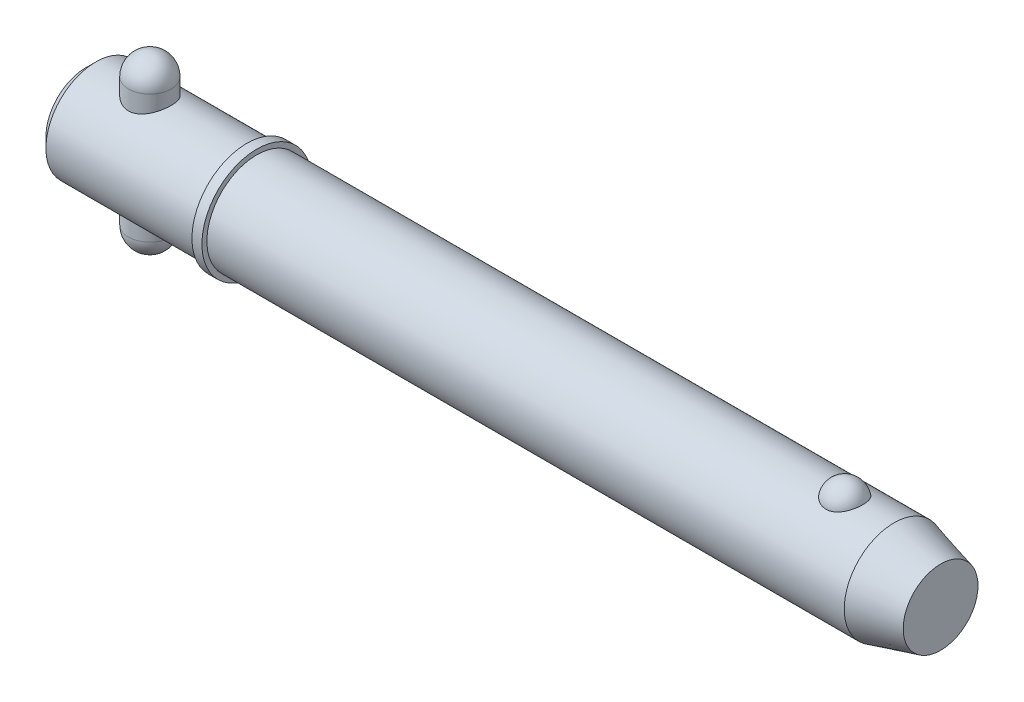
ISO-10303-21;
HEADER;
FILE_DESCRIPTION(('STEP AP214'),'2;1');
FILE_NAME('part.step','',(''),(''),'','','');
FILE_SCHEMA(('AUTOMOTIVE_DESIGN { 1 0 10303 214 1 1 1 1 }'));
ENDSEC;
DATA;
#1=APPLICATION_CONTEXT('core data for automotive mechanical design processes');
#2=APPLICATION_PROTOCOL_DEFINITION('international standard','automotive_design',2000,#1);
#3=PRODUCT_CONTEXT('',#1,'mechanical');
#4=PRODUCT('Part','Part','',(#3));
#5=PRODUCT_RELATED_PRODUCT_CATEGORY('part','',(#4));
#6=PRODUCT_DEFINITION_FORMATION('','',#4);
#7=PRODUCT_DEFINITION_CONTEXT('part definition',#1,'design');
#8=PRODUCT_DEFINITION('design','',#6,#7);
#9=PRODUCT_DEFINITION_SHAPE('','',#8);
#10=(LENGTH_UNIT() NAMED_UNIT(*) SI_UNIT(.MILLI.,.METRE.));
#11=(NAMED_UNIT(*) PLANE_ANGLE_UNIT() SI_UNIT($,.RADIAN.));
#12=(NAMED_UNIT(*) SI_UNIT($,.STERADIAN.) SOLID_ANGLE_UNIT());
#13=UNCERTAINTY_MEASURE_WITH_UNIT(LENGTH_MEASURE(1.E-05),#10,'distance_accuracy_value','');
#14=(GEOMETRIC_REPRESENTATION_CONTEXT(3) GLOBAL_UNCERTAINTY_ASSIGNED_CONTEXT((#13)) GLOBAL_UNIT_ASSIGNED_CONTEXT((#10,
#11,#12)) REPRESENTATION_CONTEXT('',''));
#15=CARTESIAN_POINT('',(0.,0.,0.));
#16=DIRECTION('',(0.,0.,1.));
#17=DIRECTION('',(1.,0.,0.));
#18=AXIS2_PLACEMENT_3D('',#15,#16,#17);
#19=CARTESIAN_POINT('',(14.28,19.05,0.));
#20=DIRECTION('',(0.,-1.,0.));
#21=DIRECTION('',(0.,0.,-1.));
#22=AXIS2_PLACEMENT_3D('',#19,#20,#21);
#23=CYLINDRICAL_SURFACE('',#22,4.76);
#24=CARTESIAN_POINT('',(14.28,-14.29,0.));
#25=DIRECTION('',(0.,-1.,0.));
#26=DIRECTION('',(0.,0.,-1.));
#27=AXIS2_PLACEMENT_3D('',#24,#25,#26);
#28=CIRCLE('',#27,4.76);
#29=CARTESIAN_POINT('',(14.28,-14.29,-4.76));
#30=VERTEX_POINT('',#29);
#31=EDGE_CURVE('P0_E10',#30,#30,#28,.F.);
#32=CARTESIAN_POINT('',(14.28,14.29,0.));
#33=DIRECTION('',(0.,-1.,0.));
#34=DIRECTION('',(0.,0.,-1.));
#35=AXIS2_PLACEMENT_3D('',#32,#33,#34);
#36=CIRCLE('',#35,4.76);
#37=CARTESIAN_POINT('',(14.28,14.29,-4.76));
#38=VERTEX_POINT('',#37);
#39=EDGE_CURVE('P0_E21',#38,#38,#36,.T.);
#40=CARTESIAN_POINT('',(14.28,-14.29,-4.76));
#41=CARTESIAN_POINT('',(14.28,-13.9922916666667,-4.76));
#42=CARTESIAN_POINT('',(14.28,-13.6945833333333,-4.76));
#43=CARTESIAN_POINT('',(14.28,-13.0991666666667,-4.76));
#44=CARTESIAN_POINT('',(14.28,-12.8014583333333,-4.76));
#45=CARTESIAN_POINT('',(14.28,-12.2060416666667,-4.76));
#46=CARTESIAN_POINT('',(14.28,-11.9083333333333,-4.76));
#47=CARTESIAN_POINT('',(14.28,-11.3129166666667,-4.76));
#48=CARTESIAN_POINT('',(14.28,-11.0152083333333,-4.76));
#49=CARTESIAN_POINT('',(14.28,-10.4197916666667,-4.76));
#50=CARTESIAN_POINT('',(14.28,-10.1220833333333,-4.76));
#51=CARTESIAN_POINT('',(14.28,-9.52666666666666,-4.76));
#52=CARTESIAN_POINT('',(14.28,-9.22895833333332,-4.76));
#53=CARTESIAN_POINT('',(14.28,-8.63354166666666,-4.76));
#54=CARTESIAN_POINT('',(14.28,-8.33583333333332,-4.76));
#55=CARTESIAN_POINT('',(14.28,-7.74041666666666,-4.76));
#56=CARTESIAN_POINT('',(14.28,-7.44270833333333,-4.76));
#57=CARTESIAN_POINT('',(14.28,-6.84729166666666,-4.76));
#58=CARTESIAN_POINT('',(14.28,-6.54958333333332,-4.76));
#59=CARTESIAN_POINT('',(14.28,-5.95416666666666,-4.76));
#60=CARTESIAN_POINT('',(14.28,-5.65645833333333,-4.76));
#61=CARTESIAN_POINT('',(14.28,-5.06104166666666,-4.76));
#62=CARTESIAN_POINT('',(14.28,-4.76333333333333,-4.76));
#63=CARTESIAN_POINT('',(14.28,-4.16791666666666,-4.76));
#64=CARTESIAN_POINT('',(14.28,-3.87020833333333,-4.76));
#65=CARTESIAN_POINT('',(14.28,-3.27479166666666,-4.76));
#66=CARTESIAN_POINT('',(14.28,-2.97708333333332,-4.76));
#67=CARTESIAN_POINT('',(14.28,-2.38166666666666,-4.76));
#68=CARTESIAN_POINT('',(14.28,-2.08395833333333,-4.76));
#69=CARTESIAN_POINT('',(14.28,-1.48854166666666,-4.76));
#70=CARTESIAN_POINT('',(14.28,-1.19083333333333,-4.76));
#71=CARTESIAN_POINT('',(14.28,-0.595416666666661,-4.76));
#72=CARTESIAN_POINT('',(14.28,-0.297708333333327,-4.76));
#73=CARTESIAN_POINT('',(14.28,0.297708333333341,-4.76));
#74=CARTESIAN_POINT('',(14.28,0.595416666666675,-4.76));
#75=CARTESIAN_POINT('',(14.28,1.19083333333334,-4.76));
#76=CARTESIAN_POINT('',(14.28,1.48854166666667,-4.76));
#77=CARTESIAN_POINT('',(14.28,2.08395833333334,-4.76));
#78=CARTESIAN_POINT('',(14.28,2.38166666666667,-4.76));
#79=CARTESIAN_POINT('',(14.28,2.97708333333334,-4.76));
#80=CARTESIAN_POINT('',(14.28,3.27479166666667,-4.76));
#81=CARTESIAN_POINT('',(14.28,3.87020833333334,-4.76));
#82=CARTESIAN_POINT('',(14.28,4.16791666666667,-4.76));
#83=CARTESIAN_POINT('',(14.28,4.76333333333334,-4.76));
#84=CARTESIAN_POINT('',(14.28,5.06104166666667,-4.76));
#85=CARTESIAN_POINT('',(14.28,5.65645833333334,-4.76));
#86=CARTESIAN_POINT('',(14.28,5.95416666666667,-4.76));
#87=CARTESIAN_POINT('',(14.28,6.54958333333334,-4.76));
#88=CARTESIAN_POINT('',(14.28,6.84729166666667,-4.76));
#89=CARTESIAN_POINT('',(14.28,7.44270833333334,-4.76));
#90=CARTESIAN_POINT('',(14.28,7.74041666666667,-4.76));
#91=CARTESIAN_POINT('',(14.28,8.33583333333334,-4.76));
#92=CARTESIAN_POINT('',(14.28,8.63354166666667,-4.76));
#93=CARTESIAN_POINT('',(14.28,9.22895833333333,-4.76));
#94=CARTESIAN_POINT('',(14.28,9.52666666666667,-4.76));
#95=CARTESIAN_POINT('',(14.28,10.1220833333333,-4.76));
#96=CARTESIAN_POINT('',(14.28,10.4197916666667,-4.76));
#97=CARTESIAN_POINT('',(14.28,11.0152083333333,-4.76));
#98=CARTESIAN_POINT('',(14.28,11.3129166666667,-4.76));
#99=CARTESIAN_POINT('',(14.28,11.9083333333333,-4.76));
#100=CARTESIAN_POINT('',(14.28,12.2060416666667,-4.76));
#101=CARTESIAN_POINT('',(14.28,12.8014583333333,-4.76));
#102=CARTESIAN_POINT('',(14.28,13.0991666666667,-4.76));
#103=CARTESIAN_POINT('',(14.28,13.6945833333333,-4.76));
#104=CARTESIAN_POINT('',(14.28,13.9922916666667,-4.76));
#105=CARTESIAN_POINT('',(14.28,14.29,-4.76));
#106=B_SPLINE_CURVE_WITH_KNOTS('',3,(#40,#41,#42,#43,#44,#45,#46,#47,#48,#49,#50,#51,#52,#53,
#54,#55,#56,#57,#58,#59,#60,#61,#62,#63,#64,#65,#66,#67,#68,#69,#70,#71,#72,#73,#74,#75,#76,#77,
#78,#79,#80,#81,#82,#83,#84,#85,#86,#87,#88,#89,#90,#91,#92,#93,#94,#95,#96,#97,#98,#99,#100,
#101,#102,#103,#104,#105),.UNSPECIFIED.,.F.,.F.,(4,2,2,2,2,2,2,2,2,2,2,2,2,2,2,2,2,2,2,2,2,2,2,
2,2,2,2,2,2,2,2,2,4),(0.,0.893125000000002,1.78625,2.67937499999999,3.5725,4.465625,5.35875,
6.25187499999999,7.145,8.038125,8.93125,9.82437499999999,10.7175,11.610625,12.50375,13.396875,
14.29,15.183125,16.07625,16.969375,17.8625,18.755625,19.64875,20.541875,21.435,22.328125,
23.22125,24.114375,25.0075,25.900625,26.79375,27.686875,28.58),.UNSPECIFIED.);
#107=EDGE_CURVE('P0_BSEAM14',#30,#38,#106,.T.);
#108=ORIENTED_EDGE('',*,*,#31,.T.);
#109=ORIENTED_EDGE('',*,*,#39,.T.);
#110=ORIENTED_EDGE('',*,*,#107,.T.);
#111=ORIENTED_EDGE('',*,*,#107,.F.);
#112=EDGE_LOOP('',(#108,#110,#109,#111));
#113=FACE_BOUND('',#112,.T.);
#114=ADVANCED_FACE('P0_F14',(#113),#23,.T.);
#115=CARTESIAN_POINT('',(14.28,-14.29,0.));
#116=DIRECTION('',(0.,0.,1.));
#117=DIRECTION('',(1.,0.,0.));
#118=AXIS2_PLACEMENT_3D('',#115,#116,#117);
#119=SPHERICAL_SURFACE('',#118,4.76);
#120=CARTESIAN_POINT('',(14.28,-14.29,0.));
#121=DIRECTION('',(0.,-1.,0.));
#122=DIRECTION('',(0.,0.,-1.));
#123=AXIS2_PLACEMENT_3D('',#120,#121,#122);
#124=SPHERICAL_SURFACE('',#123,4.76);
#125=ORIENTED_EDGE('',*,*,#31,.F.);
#126=EDGE_LOOP('',(#125));
#127=FACE_BOUND('',#126,.T.);
#128=ADVANCED_FACE('P0_F29',(#127),#124,.T.);
#129=CARTESIAN_POINT('',(14.28,14.29,0.));
#130=DIRECTION('',(0.,0.,1.));
#131=DIRECTION('',(1.,0.,0.));
#132=AXIS2_PLACEMENT_3D('',#129,#130,#131);
#133=SPHERICAL_SURFACE('',#132,4.76);
#134=CARTESIAN_POINT('',(14.28,14.29,0.));
#135=DIRECTION('',(0.,-1.,0.));
#136=DIRECTION('',(0.,0.,-1.));
#137=AXIS2_PLACEMENT_3D('',#134,#135,#136);
#138=SPHERICAL_SURFACE('',#137,4.76);
#139=ORIENTED_EDGE('',*,*,#39,.F.);
#140=EDGE_LOOP('',(#139));
#141=FACE_BOUND('',#140,.T.);
#142=ADVANCED_FACE('P0_F16',(#141),#138,.T.);
#143=CLOSED_SHELL('',(#114,#128,#142));
#144=MANIFOLD_SOLID_BREP('P0_B1',#143);
#145=CARTESIAN_POINT('',(0.,0.,0.));
#146=DIRECTION('',(1.,0.,0.));
#147=DIRECTION('',(0.,0.,-1.));
#148=AXIS2_PLACEMENT_3D('',#145,#146,#147);
#149=CYLINDRICAL_SURFACE('',#148,11.115);
#150=CARTESIAN_POINT('',(180.129563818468,0.,0.));
#151=DIRECTION('',(1.,0.,0.));
#152=DIRECTION('',(0.,0.,-1.));
#153=AXIS2_PLACEMENT_3D('',#150,#151,#152);
#154=CIRCLE('',#153,11.115);
#155=CARTESIAN_POINT('',(180.129563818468,0.,-11.115));
#156=VERTEX_POINT('',#155);
#157=EDGE_CURVE('P1_E81',#156,#156,#154,.T.);
#158=ORIENTED_EDGE('',*,*,#157,.F.);
#159=EDGE_LOOP('',(#158));
#160=FACE_BOUND('',#159,.T.);
#161=CARTESIAN_POINT('',(38.1,0.,0.));
#162=DIRECTION('',(1.,0.,0.));
#163=DIRECTION('',(0.,0.,-1.));
#164=AXIS2_PLACEMENT_3D('',#161,#162,#163);
#165=CIRCLE('',#164,11.115);
#166=CARTESIAN_POINT('',(38.1,0.,-11.115));
#167=VERTEX_POINT('',#166);
#168=EDGE_CURVE('P1_E85',#167,#167,#165,.T.);
#169=ORIENTED_EDGE('',*,*,#168,.T.);
#170=EDGE_LOOP('',(#169));
#171=FACE_BOUND('',#170,.T.);
#172=CARTESIAN_POINT('',(169.131068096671,10.3028087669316,4.17077409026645));
#173=CARTESIAN_POINT('',(168.914775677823,10.3028003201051,4.17078240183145));
#174=CARTESIAN_POINT('',(168.698548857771,10.3098895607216,4.15340593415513));
#175=CARTESIAN_POINT('',(168.272540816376,10.3373834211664,4.08449540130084));
#176=CARTESIAN_POINT('',(168.062757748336,10.3577841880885,4.03297121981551));
#177=CARTESIAN_POINT('',(167.655782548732,10.4095237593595,3.89746513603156));
#178=CARTESIAN_POINT('',(167.458572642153,10.4408466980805,3.81353029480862));
#179=CARTESIAN_POINT('',(167.081338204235,10.5110236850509,3.61560339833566));
#180=CARTESIAN_POINT('',(166.901317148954,10.5498792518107,3.50160528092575));
#181=CARTESIAN_POINT('',(166.557684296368,10.6322884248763,3.24292464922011));
#182=CARTESIAN_POINT('',(166.394686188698,10.6759443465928,3.09746040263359));
#183=CARTESIAN_POINT('',(166.094591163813,10.7625291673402,2.7817192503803));
#184=CARTESIAN_POINT('',(165.957499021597,10.8054579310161,2.61143778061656));
#185=CARTESIAN_POINT('',(165.706408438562,10.8881935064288,2.24226695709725));
#186=CARTESIAN_POINT('',(165.593710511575,10.9277761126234,2.04244123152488));
#187=CARTESIAN_POINT('',(165.401777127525,10.997484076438,1.62578254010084));
#188=CARTESIAN_POINT('',(165.322544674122,11.0276085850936,1.40894804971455));
#189=CARTESIAN_POINT('',(165.198303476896,11.0756732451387,0.961250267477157));
#190=CARTESIAN_POINT('',(165.153760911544,11.0934470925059,0.73023943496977));
#191=CARTESIAN_POINT('',(165.101569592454,11.1143331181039,0.263439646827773));
#192=CARTESIAN_POINT('',(165.093920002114,11.1174456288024,0.0276507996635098));
#193=CARTESIAN_POINT('',(165.11561056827,11.1087161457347,-0.440729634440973));
#194=CARTESIAN_POINT('',(165.144762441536,11.0969502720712,-0.673331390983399));
#195=CARTESIAN_POINT('',(165.239143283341,11.0597872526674,-1.12996621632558));
#196=CARTESIAN_POINT('',(165.304372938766,11.0343898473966,-1.35399912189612));
#197=CARTESIAN_POINT('',(165.46969844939,10.972515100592,-1.78750286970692));
#198=CARTESIAN_POINT('',(165.56983863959,10.9360236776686,-1.99695478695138));
#199=CARTESIAN_POINT('',(165.802940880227,10.8557595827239,-2.39520667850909));
#200=CARTESIAN_POINT('',(165.935905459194,10.8119863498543,-2.58400506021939));
#201=CARTESIAN_POINT('',(166.232407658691,10.7216733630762,-2.93635726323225));
#202=CARTESIAN_POINT('',(166.396056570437,10.675123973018,-3.09981510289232));
#203=CARTESIAN_POINT('',(166.749860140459,10.5846571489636,-3.39592247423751));
#204=CARTESIAN_POINT('',(166.940012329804,10.5407394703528,-3.52857487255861));
#205=CARTESIAN_POINT('',(167.33750141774,10.4616690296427,-3.75646057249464));
#206=CARTESIAN_POINT('',(167.54436705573,10.4263443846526,-3.85245432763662));
#207=CARTESIAN_POINT('',(167.97295417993,10.3675574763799,-4.0079874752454));
#208=CARTESIAN_POINT('',(168.194670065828,10.344090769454,-4.06754052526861));
#209=CARTESIAN_POINT('',(168.634669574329,10.3128282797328,-4.14614314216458));
#210=CARTESIAN_POINT('',(168.852565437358,10.3043040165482,-4.1670783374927));
#211=CARTESIAN_POINT('',(169.28894951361,10.3016771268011,-4.17357158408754));
#212=CARTESIAN_POINT('',(169.507437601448,10.3075716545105,-4.15913661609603));
#213=CARTESIAN_POINT('',(169.931744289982,10.3326686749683,-4.09636961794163));
#214=CARTESIAN_POINT('',(170.137745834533,10.3514555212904,-4.0490957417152));
#215=CARTESIAN_POINT('',(170.538576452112,10.399818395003,-3.92320197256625));
#216=CARTESIAN_POINT('',(170.7334046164,10.4293952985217,-3.84457953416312));
#217=CARTESIAN_POINT('',(171.111191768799,10.4969600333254,-3.65612410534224));
#218=CARTESIAN_POINT('',(171.293797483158,10.5351178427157,-3.54564545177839));
#219=CARTESIAN_POINT('',(171.638204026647,10.6154999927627,-3.29718036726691));
#220=CARTESIAN_POINT('',(171.800000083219,10.657725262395,-3.15918764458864));
#221=CARTESIAN_POINT('',(172.106959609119,10.744212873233,-2.85163580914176));
#222=CARTESIAN_POINT('',(172.250891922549,10.7884718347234,-2.68084605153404));
#223=CARTESIAN_POINT('',(172.509237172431,10.872374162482,-2.31721864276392));
#224=CARTESIAN_POINT('',(172.623644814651,10.9120167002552,-2.12437704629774));
#225=CARTESIAN_POINT('',(172.823873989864,10.9838919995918,-1.71516999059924));
#226=CARTESIAN_POINT('',(172.90866178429,11.0158465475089,-1.49824866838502));
#227=CARTESIAN_POINT('',(173.04268382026,11.0673523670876,-1.05228572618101));
#228=CARTESIAN_POINT('',(173.091917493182,11.086903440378,-0.823243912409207));
#229=CARTESIAN_POINT('',(173.153891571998,11.1116323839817,-0.359087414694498));
#230=CARTESIAN_POINT('',(173.166566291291,11.1167843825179,-0.12396256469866));
#231=CARTESIAN_POINT('',(173.154973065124,11.1121144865,0.345220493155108));
#232=CARTESIAN_POINT('',(173.130705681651,11.1022928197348,0.579278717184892));
#233=CARTESIAN_POINT('',(173.045907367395,11.0687504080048,1.03866534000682));
#234=CARTESIAN_POINT('',(172.985529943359,11.0450885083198,1.26402641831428));
#235=CARTESIAN_POINT('',(172.829853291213,10.9863185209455,1.70076772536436));
#236=CARTESIAN_POINT('',(172.734551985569,10.9512097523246,1.91214712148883));
#237=CARTESIAN_POINT('',(172.510397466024,10.8729733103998,2.316083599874));
#238=CARTESIAN_POINT('',(172.381380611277,10.8298068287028,2.50854240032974));
#239=CARTESIAN_POINT('',(172.092732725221,10.7401896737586,2.86808766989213));
#240=CARTESIAN_POINT('',(171.933102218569,10.6937390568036,3.03517457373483));
#241=CARTESIAN_POINT('',(171.587534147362,10.6029321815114,3.33857581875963));
#242=CARTESIAN_POINT('',(171.401708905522,10.5585680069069,3.47501541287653));
#243=CARTESIAN_POINT('',(171.007875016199,10.4769321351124,3.71390897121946));
#244=CARTESIAN_POINT('',(170.799863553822,10.439661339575,3.81635861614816));
#245=CARTESIAN_POINT('',(170.354066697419,10.3749407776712,3.98910631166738));
#246=CARTESIAN_POINT('',(170.115234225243,10.3482457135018,4.05700929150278));
#247=CARTESIAN_POINT('',(169.627925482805,10.312188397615,4.14782844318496));
#248=CARTESIAN_POINT('',(169.379453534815,10.3028184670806,4.17076454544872));
#249=CARTESIAN_POINT('',(169.131068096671,10.3028087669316,4.17077409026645));
#250=B_SPLINE_CURVE_WITH_KNOTS('',3,(#172,#173,#174,#175,#176,#177,#178,#179,#180,#181,#182,
#183,#184,#185,#186,#187,#188,#189,#190,#191,#192,#193,#194,#195,#196,#197,#198,#199,#200,#201,
#202,#203,#204,#205,#206,#207,#208,#209,#210,#211,#212,#213,#214,#215,#216,#217,#218,#219,#220,
#221,#222,#223,#224,#225,#226,#227,#228,#229,#230,#231,#232,#233,#234,#235,#236,#237,#238,#239,
#240,#241,#242,#243,#244,#245,#246,#247,#248,#249),.UNSPECIFIED.,.T.,.F.,(4,2,2,2,2,2,2,2,2,2,2,
2,2,2,2,2,2,2,2,2,2,2,2,2,2,2,2,2,2,2,2,2,2,2,2,2,2,2,4),(0.,0.647966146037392,1.29574482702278,
1.9425864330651,2.58955857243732,3.25496465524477,3.92049326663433,4.61566368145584,
5.31089647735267,6.01531821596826,6.71972398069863,7.42054043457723,8.12137023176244,
8.82309331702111,9.5248704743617,10.2292439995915,10.9335519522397,11.6223330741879,
12.3108558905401,12.9647664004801,13.6185478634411,14.252184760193,14.8858731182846,
15.5334360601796,16.1811472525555,16.8611459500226,17.5412664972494,18.2431855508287,
18.9451158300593,19.6483065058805,20.3514864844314,21.0516982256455,21.7519516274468,
22.4556690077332,23.1593743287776,23.8601491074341,24.5610129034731,25.3054529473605,
26.049562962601),.UNSPECIFIED.);
#251=CARTESIAN_POINT('',(169.131068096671,10.3028087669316,4.17077409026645));
#252=VERTEX_POINT('',#251);
#253=EDGE_CURVE('P1_E35',#252,#252,#250,.T.);
#254=ORIENTED_EDGE('',*,*,#253,.T.);
#255=EDGE_LOOP('',(#254));
#256=FACE_BOUND('',#255,.T.);
#257=ADVANCED_FACE('P1_F13',(#160,#171,#256),#149,.T.);
#258=CARTESIAN_POINT('',(0.,0.,0.));
#259=DIRECTION('',(-1.,0.,0.));
#260=DIRECTION('',(0.,0.,1.));
#261=AXIS2_PLACEMENT_3D('',#258,#259,#260);
#262=PLANE('',#261);
#263=CARTESIAN_POINT('',(0.,0.,0.));
#264=DIRECTION('',(1.,0.,0.));
#265=DIRECTION('',(0.,0.,-1.));
#266=AXIS2_PLACEMENT_3D('',#263,#264,#265);
#267=CIRCLE('',#266,8.892);
#268=CARTESIAN_POINT('',(0.,0.,-8.892));
#269=VERTEX_POINT('',#268);
#270=EDGE_CURVE('P1_E9',#269,#269,#267,.T.);
#271=ORIENTED_EDGE('',*,*,#270,.F.);
#272=EDGE_LOOP('',(#271));
#273=FACE_BOUND('',#272,.T.);
#274=ADVANCED_FACE('P1_F15',(#273),#262,.T.);
#275=CARTESIAN_POINT('',(2.22299999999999,0.,0.));
#276=DIRECTION('',(1.,0.,0.));
#277=DIRECTION('',(0.,0.,-1.));
#278=AXIS2_PLACEMENT_3D('',#275,#276,#277);
#279=CONICAL_SURFACE('',#278,11.115,0.78539816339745);
#280=ORIENTED_EDGE('',*,*,#270,.T.);
#281=EDGE_LOOP('',(#280));
#282=FACE_BOUND('',#281,.T.);
#283=CARTESIAN_POINT('',(2.22299999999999,0.,0.));
#284=DIRECTION('',(1.,0.,0.));
#285=DIRECTION('',(0.,0.,-1.));
#286=AXIS2_PLACEMENT_3D('',#283,#284,#285);
#287=CIRCLE('',#286,11.115);
#288=CARTESIAN_POINT('',(2.22299999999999,0.,-11.115));
#289=VERTEX_POINT('',#288);
#290=EDGE_CURVE('P1_E26',#289,#289,#287,.T.);
#291=ORIENTED_EDGE('',*,*,#290,.F.);
#292=EDGE_LOOP('',(#291));
#293=FACE_BOUND('',#292,.T.);
#294=ADVANCED_FACE('P1_F77',(#282,#293),#279,.T.);
#295=CARTESIAN_POINT('',(0.,0.,0.));
#296=DIRECTION('',(1.,0.,0.));
#297=DIRECTION('',(0.,0.,-1.));
#298=AXIS2_PLACEMENT_3D('',#295,#296,#297);
#299=CYLINDRICAL_SURFACE('',#298,11.115);
#300=CARTESIAN_POINT('',(14.28,-10.0441836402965,4.76));
#301=CARTESIAN_POINT('',(14.1533731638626,-10.0441846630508,4.75999904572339));
#302=CARTESIAN_POINT('',(14.0267055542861,-10.0465865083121,4.75493985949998));
#303=CARTESIAN_POINT('',(13.774298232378,-10.0561141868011,4.73475585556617));
#304=CARTESIAN_POINT('',(13.6485591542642,-10.0632429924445,4.71962470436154));
#305=CARTESIAN_POINT('',(13.3987500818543,-10.0819979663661,4.67942666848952));
#306=CARTESIAN_POINT('',(13.2746840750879,-10.0936334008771,4.65433930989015));
#307=CARTESIAN_POINT('',(13.0293244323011,-10.1210146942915,4.59449317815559));
#308=CARTESIAN_POINT('',(12.9080319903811,-10.1367622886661,4.55973032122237));
#309=CARTESIAN_POINT('',(12.669614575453,-10.1717810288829,4.48106435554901));
#310=CARTESIAN_POINT('',(12.5524727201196,-10.1910352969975,4.4372048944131));
#311=CARTESIAN_POINT('',(12.3224300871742,-10.2325403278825,4.34063417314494));
#312=CARTESIAN_POINT('',(12.2095309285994,-10.2547922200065,4.28791957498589));
#313=CARTESIAN_POINT('',(11.8782785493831,-10.3250879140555,4.11715127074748));
#314=CARTESIAN_POINT('',(11.6670799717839,-10.3767168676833,3.98637638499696));
#315=CARTESIAN_POINT('',(11.2564039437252,-10.4874309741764,3.68567149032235));
#316=CARTESIAN_POINT('',(11.0583793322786,-10.5467772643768,3.51386978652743));
#317=CARTESIAN_POINT('',(10.6927724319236,-10.6641377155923,3.13969960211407));
#318=CARTESIAN_POINT('',(10.5252022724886,-10.7221513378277,2.93731900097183));
#319=CARTESIAN_POINT('',(10.2965609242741,-10.8050020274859,2.60935726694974));
#320=CARTESIAN_POINT('',(10.2227768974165,-10.8324811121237,2.49310321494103));
#321=CARTESIAN_POINT('',(10.0853380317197,-10.884703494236,2.25418999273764));
#322=CARTESIAN_POINT('',(10.0216789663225,-10.9094479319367,2.13153352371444));
#323=CARTESIAN_POINT('',(9.90506238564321,-10.9554932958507,1.88060370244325));
#324=CARTESIAN_POINT('',(9.85210574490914,-10.9767939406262,1.7523298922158));
#325=CARTESIAN_POINT('',(9.75746464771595,-11.0153112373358,1.49115740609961));
#326=CARTESIAN_POINT('',(9.71577447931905,-11.0325299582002,1.35826111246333));
#327=CARTESIAN_POINT('',(9.64605475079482,-11.0615607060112,1.09614539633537));
#328=CARTESIAN_POINT('',(9.61740732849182,-11.0736151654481,0.96711700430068));
#329=CARTESIAN_POINT('',(9.57092026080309,-11.0932687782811,0.706847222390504));
#330=CARTESIAN_POINT('',(9.55307574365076,-11.1008699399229,0.575606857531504));
#331=CARTESIAN_POINT('',(9.52838640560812,-11.1114054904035,0.31192917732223));
#332=CARTESIAN_POINT('',(9.52153986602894,-11.114340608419,0.179492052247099));
#333=CARTESIAN_POINT('',(9.51892405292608,-11.1154607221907,-0.0855090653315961));
#334=CARTESIAN_POINT('',(9.52315432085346,-11.1136459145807,-0.218073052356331));
#335=CARTESIAN_POINT('',(9.542009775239,-11.1055891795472,-0.473709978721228));
#336=CARTESIAN_POINT('',(9.55594693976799,-11.099640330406,-0.596843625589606));
#337=CARTESIAN_POINT('',(9.59332832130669,-11.0837823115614,-0.841440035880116));
#338=CARTESIAN_POINT('',(9.61677567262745,-11.0738718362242,-0.962902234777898));
#339=CARTESIAN_POINT('',(9.67294089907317,-11.0503378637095,-1.20325684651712));
#340=CARTESIAN_POINT('',(9.70565569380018,-11.0367156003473,-1.32215009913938));
#341=CARTESIAN_POINT('',(9.78005008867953,-11.0060908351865,-1.55666640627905));
#342=CARTESIAN_POINT('',(9.82173311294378,-10.9890870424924,-1.67228819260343));
#343=CARTESIAN_POINT('',(9.96110379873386,-10.9330280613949,-2.01656166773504));
#344=CARTESIAN_POINT('',(10.0722987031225,-10.8892801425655,-2.23915547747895));
#345=CARTESIAN_POINT('',(10.3268588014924,-10.7934745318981,-2.66299199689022));
#346=CARTESIAN_POINT('',(10.4702355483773,-10.7414138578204,-2.86422700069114));
#347=CARTESIAN_POINT('',(10.7973904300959,-10.6296201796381,-3.25557775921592));
#348=CARTESIAN_POINT('',(10.9833705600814,-10.569604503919,-3.443774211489));
#349=CARTESIAN_POINT('',(11.3844486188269,-10.4514707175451,-3.78722133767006));
#350=CARTESIAN_POINT('',(11.5995590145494,-10.3933534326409,-3.94245783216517));
#351=CARTESIAN_POINT('',(11.9444340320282,-10.311516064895,-4.14990014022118));
#352=CARTESIAN_POINT('',(12.0654579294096,-10.2847012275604,-4.21573894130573));
#353=CARTESIAN_POINT('',(12.3132718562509,-10.2342051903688,-4.33688518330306));
#354=CARTESIAN_POINT('',(12.4400593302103,-10.2105226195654,-4.39219723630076));
#355=CARTESIAN_POINT('',(12.6985418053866,-10.1671237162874,-4.49174500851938));
#356=CARTESIAN_POINT('',(12.8302359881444,-10.1474067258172,-4.53598256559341));
#357=CARTESIAN_POINT('',(13.0975061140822,-10.1126841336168,-4.61287629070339));
#358=CARTESIAN_POINT('',(13.233079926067,-10.0976759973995,-4.64553869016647));
#359=CARTESIAN_POINT('',(13.4978553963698,-10.0737863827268,-4.6971059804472));
#360=CARTESIAN_POINT('',(13.6268754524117,-10.0645618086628,-4.716785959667));
#361=CARTESIAN_POINT('',(13.8862990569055,-10.051062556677,-4.74548419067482));
#362=CARTESIAN_POINT('',(14.0167019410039,-10.0467856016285,-4.75450734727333));
#363=CARTESIAN_POINT('',(14.277859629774,-10.0433352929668,-4.76179143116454));
#364=CARTESIAN_POINT('',(14.4086143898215,-10.0441613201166,-4.76005366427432));
#365=CARTESIAN_POINT('',(14.6694025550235,-10.0508838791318,-4.74584231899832));
#366=CARTESIAN_POINT('',(14.7994359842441,-10.0567802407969,-4.73336910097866));
#367=CARTESIAN_POINT('',(15.0487369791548,-10.0728449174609,-4.69907984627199));
#368=CARTESIAN_POINT('',(15.1681238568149,-10.0826872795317,-4.67797462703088));
#369=CARTESIAN_POINT('',(15.4045894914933,-10.1062580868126,-4.62682977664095));
#370=CARTESIAN_POINT('',(15.5216674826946,-10.1199877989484,-4.59678723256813));
#371=CARTESIAN_POINT('',(15.868278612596,-10.1664161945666,-4.49365911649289));
#372=CARTESIAN_POINT('',(16.0933756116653,-10.2043671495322,-4.40754694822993));
#373=CARTESIAN_POINT('',(16.5357981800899,-10.2919879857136,-4.19898201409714));
#374=CARTESIAN_POINT('',(16.7523611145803,-10.3420954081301,-4.07511281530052));
#375=CARTESIAN_POINT('',(17.1627188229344,-10.4477911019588,-3.7959429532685));
#376=CARTESIAN_POINT('',(17.3565033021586,-10.5033818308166,-3.64062816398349));
#377=CARTESIAN_POINT('',(17.7334034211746,-10.6196376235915,-3.28693729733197));
#378=CARTESIAN_POINT('',(17.9141276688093,-10.6803237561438,-3.08599175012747));
#379=CARTESIAN_POINT('',(18.1582189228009,-10.7666348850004,-2.76320365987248));
#380=CARTESIAN_POINT('',(18.2351223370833,-10.7946346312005,-2.65197124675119));
#381=CARTESIAN_POINT('',(18.3793967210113,-10.8483267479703,-2.42297927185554));
#382=CARTESIAN_POINT('',(18.4467718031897,-10.87402011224,-2.30522255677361));
#383=CARTESIAN_POINT('',(18.5717669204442,-10.9225249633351,-2.06324665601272));
#384=CARTESIAN_POINT('',(18.6293326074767,-10.9453202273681,-1.93899615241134));
#385=CARTESIAN_POINT('',(18.73370006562,-10.9872100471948,-1.6855059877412));
#386=CARTESIAN_POINT('',(18.7805065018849,-11.0063062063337,-1.55626851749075));
#387=CARTESIAN_POINT('',(18.8628731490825,-11.0402419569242,-1.29375150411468));
#388=CARTESIAN_POINT('',(18.8984366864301,-11.0550828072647,-1.16047316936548));
#389=CARTESIAN_POINT('',(18.9579183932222,-11.0800638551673,-0.890912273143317));
#390=CARTESIAN_POINT('',(18.9818374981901,-11.0902044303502,-0.75462995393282));
#391=CARTESIAN_POINT('',(19.0164177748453,-11.104911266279,-0.490295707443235));
#392=CARTESIAN_POINT('',(19.027922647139,-11.1098318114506,-0.362373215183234));
#393=CARTESIAN_POINT('',(19.040554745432,-11.1152360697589,-0.105876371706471));
#394=CARTESIAN_POINT('',(19.0416784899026,-11.1157182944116,0.0226981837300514));
#395=CARTESIAN_POINT('',(19.0335275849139,-11.1122291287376,0.27938352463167));
#396=CARTESIAN_POINT('',(19.0242587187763,-11.1082602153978,0.407494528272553));
#397=CARTESIAN_POINT('',(18.9954320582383,-11.0959792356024,0.662388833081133));
#398=CARTESIAN_POINT('',(18.9758704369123,-11.0876655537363,0.789171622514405));
#399=CARTESIAN_POINT('',(18.9276379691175,-11.0673259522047,1.03545890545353));
#400=CARTESIAN_POINT('',(18.8993573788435,-11.0554596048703,1.15505309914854));
#401=CARTESIAN_POINT('',(18.8337694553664,-11.0282166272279,1.39134516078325));
#402=CARTESIAN_POINT('',(18.7964589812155,-11.0128387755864,1.5080420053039));
#403=CARTESIAN_POINT('',(18.671464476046,-10.9619666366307,1.85262797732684));
#404=CARTESIAN_POINT('',(18.5706772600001,-10.9217161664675,2.07521484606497));
#405=CARTESIAN_POINT('',(18.33202463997,-10.8301378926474,2.51061719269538));
#406=CARTESIAN_POINT('',(18.1926775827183,-10.7783885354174,2.72252375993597));
#407=CARTESIAN_POINT('',(17.8829747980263,-10.669863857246,3.12088015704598));
#408=CARTESIAN_POINT('',(17.7126068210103,-10.6130865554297,3.30731987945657));
#409=CARTESIAN_POINT('',(17.3310036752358,-10.495668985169,3.66358491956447));
#410=CARTESIAN_POINT('',(17.1177010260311,-10.4350471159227,3.83122543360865));
#411=CARTESIAN_POINT('',(16.7778915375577,-10.3495418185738,4.05420569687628));
#412=CARTESIAN_POINT('',(16.6612023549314,-10.3219229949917,4.12383380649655));
#413=CARTESIAN_POINT('',(16.4218466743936,-10.2693487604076,4.25306463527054));
#414=CARTESIAN_POINT('',(16.2991829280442,-10.2443921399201,4.31267191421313));
#415=CARTESIAN_POINT('',(16.0488008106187,-10.1979981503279,4.42126071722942));
#416=CARTESIAN_POINT('',(15.9210894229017,-10.1765561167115,4.47025635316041));
#417=CARTESIAN_POINT('',(15.6613937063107,-10.1379191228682,4.55720152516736));
#418=CARTESIAN_POINT('',(15.5294115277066,-10.1207220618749,4.59515652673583));
#419=CARTESIAN_POINT('',(15.2624981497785,-10.091252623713,4.65951684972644));
#420=CARTESIAN_POINT('',(15.1275757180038,-10.0789672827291,4.68595259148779));
#421=CARTESIAN_POINT('',(14.8556442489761,-10.0597530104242,4.72706206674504));
#422=CARTESIAN_POINT('',(14.7186368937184,-10.0528199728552,4.74174481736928));
#423=CARTESIAN_POINT('',(14.5310955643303,-10.047196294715,4.75363843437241));
#424=CARTESIAN_POINT('',(14.48091543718,-10.0460674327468,4.75602323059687));
#425=CARTESIAN_POINT('',(14.3804923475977,-10.044560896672,4.7592042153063));
#426=CARTESIAN_POINT('',(14.3302493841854,-10.0441832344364,4.76000037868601));
#427=CARTESIAN_POINT('',(14.28,-10.0441836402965,4.76));
#428=B_SPLINE_CURVE_WITH_KNOTS('',3,(#300,#301,#302,#303,#304,#305,#306,#307,#308,#309,#310,
#311,#312,#313,#314,#315,#316,#317,#318,#319,#320,#321,#322,#323,#324,#325,#326,#327,#328,#329,
#330,#331,#332,#333,#334,#335,#336,#337,#338,#339,#340,#341,#342,#343,#344,#345,#346,#347,#348,
#349,#350,#351,#352,#353,#354,#355,#356,#357,#358,#359,#360,#361,#362,#363,#364,#365,#366,#367,
#368,#369,#370,#371,#372,#373,#374,#375,#376,#377,#378,#379,#380,#381,#382,#383,#384,#385,#386,
#387,#388,#389,#390,#391,#392,#393,#394,#395,#396,#397,#398,#399,#400,#401,#402,#403,#404,#405,
#406,#407,#408,#409,#410,#411,#412,#413,#414,#415,#416,#417,#418,#419,#420,#421,#422,#423,#424,
#425,#426,#427),.UNSPECIFIED.,.T.,.F.,(4,2,2,2,2,2,2,2,2,2,2,2,2,2,2,2,2,2,2,2,2,2,2,2,2,2,2,2,
2,2,2,2,2,2,2,2,2,2,2,2,2,2,2,2,2,2,2,2,2,2,2,2,2,2,2,2,2,2,2,2,2,2,2,4),(0.,0.379828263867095,
0.759895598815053,1.14074858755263,1.52176256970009,1.90098898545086,2.28035867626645,
3.03818035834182,3.84125131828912,4.6446414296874,5.06541657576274,5.48601561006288,
5.90664899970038,6.3270687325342,6.72470503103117,7.12216187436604,7.51955659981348,
7.91693487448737,8.28868404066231,8.66055582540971,9.03230414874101,9.40419465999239,
10.1585834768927,10.9132435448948,11.7236471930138,12.5343987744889,12.9550196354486,
13.3754557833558,13.7958221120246,14.2159617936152,14.6079540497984,14.9997658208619,
15.3915300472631,15.7832811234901,16.1477615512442,16.512360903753,17.240999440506,
18.0012974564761,18.761937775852,19.5886929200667,20.0025782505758,20.4162843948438,
20.832212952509,21.2479608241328,21.6635855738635,22.0791769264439,22.4642880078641,
22.8495282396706,23.2345541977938,23.6197234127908,23.9896813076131,24.3597680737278,
25.099327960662,25.8726239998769,26.6462260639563,27.4759193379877,27.8914891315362,
28.3068693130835,28.7216936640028,29.1363123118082,29.5498292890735,29.9630287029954,
30.113753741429,30.2644811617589),.UNSPECIFIED.);
#429=CARTESIAN_POINT('',(14.28,-10.0441836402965,4.76));
#430=VERTEX_POINT('',#429);
#431=EDGE_CURVE('P1_E17',#430,#430,#428,.T.);
#432=ORIENTED_EDGE('',*,*,#431,.F.);
#433=EDGE_LOOP('',(#432));
#434=FACE_BOUND('',#433,.T.);
#435=CARTESIAN_POINT('',(14.28,10.0441836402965,4.76));
#436=CARTESIAN_POINT('',(14.4066268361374,10.0441846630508,4.75999904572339));
#437=CARTESIAN_POINT('',(14.5332944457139,10.0465865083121,4.75493985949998));
#438=CARTESIAN_POINT('',(14.785701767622,10.0561141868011,4.73475585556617));
#439=CARTESIAN_POINT('',(14.9114408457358,10.0632429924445,4.71962470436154));
#440=CARTESIAN_POINT('',(15.1612499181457,10.0819979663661,4.67942666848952));
#441=CARTESIAN_POINT('',(15.2853159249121,10.0936334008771,4.65433930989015));
#442=CARTESIAN_POINT('',(15.5306755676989,10.1210146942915,4.59449317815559));
#443=CARTESIAN_POINT('',(15.6519680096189,10.1367622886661,4.55973032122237));
#444=CARTESIAN_POINT('',(15.890385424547,10.1717810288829,4.48106435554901));
#445=CARTESIAN_POINT('',(16.0075272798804,10.1910352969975,4.4372048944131));
#446=CARTESIAN_POINT('',(16.2375699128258,10.2325403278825,4.34063417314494));
#447=CARTESIAN_POINT('',(16.3504690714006,10.2547922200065,4.28791957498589));
#448=CARTESIAN_POINT('',(16.6817214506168,10.3250879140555,4.11715127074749));
#449=CARTESIAN_POINT('',(16.8929200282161,10.3767168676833,3.98637638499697));
#450=CARTESIAN_POINT('',(17.3035960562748,10.4874309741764,3.68567149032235));
#451=CARTESIAN_POINT('',(17.5016206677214,10.5467772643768,3.51386978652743));
#452=CARTESIAN_POINT('',(17.8672275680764,10.6641377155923,3.13969960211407));
#453=CARTESIAN_POINT('',(18.0347977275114,10.7221513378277,2.93731900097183));
#454=CARTESIAN_POINT('',(18.2634390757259,10.8050020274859,2.60935726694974));
#455=CARTESIAN_POINT('',(18.3372231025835,10.8324811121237,2.49310321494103));
#456=CARTESIAN_POINT('',(18.4746619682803,10.884703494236,2.25418999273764));
#457=CARTESIAN_POINT('',(18.5383210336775,10.9094479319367,2.13153352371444));
#458=CARTESIAN_POINT('',(18.6549376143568,10.9554932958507,1.88060370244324));
#459=CARTESIAN_POINT('',(18.7078942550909,10.9767939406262,1.75232989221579));
#460=CARTESIAN_POINT('',(18.8025353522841,11.0153112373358,1.4911574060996));
#461=CARTESIAN_POINT('',(18.844225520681,11.0325299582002,1.35826111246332));
#462=CARTESIAN_POINT('',(18.9139452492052,11.0615607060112,1.09614539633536));
#463=CARTESIAN_POINT('',(18.9425926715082,11.0736151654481,0.967117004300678));
#464=CARTESIAN_POINT('',(18.9890797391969,11.0932687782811,0.706847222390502));
#465=CARTESIAN_POINT('',(19.0069242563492,11.1008699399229,0.575606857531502));
#466=CARTESIAN_POINT('',(19.0316135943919,11.1114054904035,0.311929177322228));
#467=CARTESIAN_POINT('',(19.0384601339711,11.114340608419,0.179492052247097));
#468=CARTESIAN_POINT('',(19.0410759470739,11.1154607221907,-0.0855090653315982));
#469=CARTESIAN_POINT('',(19.0368456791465,11.1136459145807,-0.218073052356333));
#470=CARTESIAN_POINT('',(19.017990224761,11.1055891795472,-0.47370997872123));
#471=CARTESIAN_POINT('',(19.004053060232,11.099640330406,-0.596843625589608));
#472=CARTESIAN_POINT('',(18.9666716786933,11.0837823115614,-0.841440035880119));
#473=CARTESIAN_POINT('',(18.9432243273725,11.0738718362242,-0.9629022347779));
#474=CARTESIAN_POINT('',(18.8870591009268,11.0503378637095,-1.20325684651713));
#475=CARTESIAN_POINT('',(18.8543443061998,11.0367156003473,-1.32215009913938));
#476=CARTESIAN_POINT('',(18.7799499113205,11.0060908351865,-1.55666640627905));
#477=CARTESIAN_POINT('',(18.7382668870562,10.9890870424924,-1.67228819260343));
#478=CARTESIAN_POINT('',(18.5988962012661,10.9330280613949,-2.01656166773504));
#479=CARTESIAN_POINT('',(18.4877012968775,10.8892801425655,-2.23915547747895));
#480=CARTESIAN_POINT('',(18.2331411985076,10.7934745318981,-2.66299199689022));
#481=CARTESIAN_POINT('',(18.0897644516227,10.7414138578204,-2.86422700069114));
#482=CARTESIAN_POINT('',(17.7626095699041,10.6296201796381,-3.25557775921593));
#483=CARTESIAN_POINT('',(17.5766294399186,10.569604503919,-3.443774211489));
#484=CARTESIAN_POINT('',(17.1755513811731,10.4514707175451,-3.78722133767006));
#485=CARTESIAN_POINT('',(16.9604409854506,10.3933534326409,-3.94245783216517));
#486=CARTESIAN_POINT('',(16.6155659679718,10.311516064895,-4.14990014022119));
#487=CARTESIAN_POINT('',(16.4945420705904,10.2847012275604,-4.21573894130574));
#488=CARTESIAN_POINT('',(16.2467281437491,10.2342051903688,-4.33688518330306));
#489=CARTESIAN_POINT('',(16.1199406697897,10.2105226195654,-4.39219723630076));
#490=CARTESIAN_POINT('',(15.8614581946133,10.1671237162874,-4.49174500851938));
#491=CARTESIAN_POINT('',(15.7297640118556,10.1474067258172,-4.53598256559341));
#492=CARTESIAN_POINT('',(15.4624938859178,10.1126841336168,-4.61287629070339));
#493=CARTESIAN_POINT('',(15.326920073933,10.0976759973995,-4.64553869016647));
#494=CARTESIAN_POINT('',(15.0621446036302,10.0737863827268,-4.6971059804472));
#495=CARTESIAN_POINT('',(14.9331245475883,10.0645618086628,-4.716785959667));
#496=CARTESIAN_POINT('',(14.6737009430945,10.051062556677,-4.74548419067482));
#497=CARTESIAN_POINT('',(14.543298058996,10.0467856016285,-4.75450734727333));
#498=CARTESIAN_POINT('',(14.2821403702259,10.0433352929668,-4.76179143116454));
#499=CARTESIAN_POINT('',(14.1513856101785,10.0441613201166,-4.76005366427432));
#500=CARTESIAN_POINT('',(13.8905974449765,10.0508838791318,-4.74584231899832));
#501=CARTESIAN_POINT('',(13.7605640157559,10.0567802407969,-4.73336910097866));
#502=CARTESIAN_POINT('',(13.5112630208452,10.0728449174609,-4.69907984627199));
#503=CARTESIAN_POINT('',(13.3918761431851,10.0826872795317,-4.67797462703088));
#504=CARTESIAN_POINT('',(13.1554105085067,10.1062580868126,-4.62682977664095));
#505=CARTESIAN_POINT('',(13.0383325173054,10.1199877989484,-4.59678723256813));
#506=CARTESIAN_POINT('',(12.691721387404,10.1664161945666,-4.49365911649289));
#507=CARTESIAN_POINT('',(12.4666243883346,10.2043671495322,-4.40754694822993));
#508=CARTESIAN_POINT('',(12.0242018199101,10.2919879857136,-4.19898201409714));
#509=CARTESIAN_POINT('',(11.8076388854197,10.3420954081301,-4.07511281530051));
#510=CARTESIAN_POINT('',(11.3972811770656,10.4477911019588,-3.7959429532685));
#511=CARTESIAN_POINT('',(11.2034966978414,10.5033818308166,-3.64062816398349));
#512=CARTESIAN_POINT('',(10.8265965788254,10.6196376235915,-3.28693729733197));
#513=CARTESIAN_POINT('',(10.6458723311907,10.6803237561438,-3.08599175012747));
#514=CARTESIAN_POINT('',(10.4017810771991,10.7666348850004,-2.76320365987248));
#515=CARTESIAN_POINT('',(10.3248776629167,10.7946346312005,-2.65197124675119));
#516=CARTESIAN_POINT('',(10.1806032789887,10.8483267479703,-2.42297927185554));
#517=CARTESIAN_POINT('',(10.1132281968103,10.87402011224,-2.30522255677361));
#518=CARTESIAN_POINT('',(9.98823307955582,10.9225249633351,-2.06324665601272));
#519=CARTESIAN_POINT('',(9.93066739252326,10.9453202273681,-1.93899615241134));
#520=CARTESIAN_POINT('',(9.82629993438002,10.9872100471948,-1.6855059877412));
#521=CARTESIAN_POINT('',(9.77949349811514,11.0063062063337,-1.55626851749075));
#522=CARTESIAN_POINT('',(9.69712685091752,11.0402419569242,-1.29375150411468));
#523=CARTESIAN_POINT('',(9.66156331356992,11.0550828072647,-1.16047316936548));
#524=CARTESIAN_POINT('',(9.60208160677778,11.0800638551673,-0.890912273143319));
#525=CARTESIAN_POINT('',(9.57816250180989,11.0902044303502,-0.754629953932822));
#526=CARTESIAN_POINT('',(9.54358222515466,11.104911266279,-0.490295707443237));
#527=CARTESIAN_POINT('',(9.53207735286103,11.1098318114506,-0.362373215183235));
#528=CARTESIAN_POINT('',(9.51944525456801,11.1152360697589,-0.105876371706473));
#529=CARTESIAN_POINT('',(9.51832151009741,11.1157182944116,0.0226981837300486));
#530=CARTESIAN_POINT('',(9.52647241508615,11.1122291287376,0.279383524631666));
#531=CARTESIAN_POINT('',(9.53574128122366,11.1082602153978,0.407494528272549));
#532=CARTESIAN_POINT('',(9.5645679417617,11.0959792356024,0.662388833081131));
#533=CARTESIAN_POINT('',(9.58412956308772,11.0876655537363,0.789171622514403));
#534=CARTESIAN_POINT('',(9.63236203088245,11.0673259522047,1.03545890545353));
#535=CARTESIAN_POINT('',(9.66064262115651,11.0554596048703,1.15505309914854));
#536=CARTESIAN_POINT('',(9.72623054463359,11.0282166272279,1.39134516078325));
#537=CARTESIAN_POINT('',(9.76354101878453,11.0128387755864,1.5080420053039));
#538=CARTESIAN_POINT('',(9.88853552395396,10.9619666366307,1.85262797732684));
#539=CARTESIAN_POINT('',(9.98932273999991,10.9217161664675,2.07521484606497));
#540=CARTESIAN_POINT('',(10.22797536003,10.8301378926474,2.51061719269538));
#541=CARTESIAN_POINT('',(10.3673224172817,10.7783885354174,2.72252375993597));
#542=CARTESIAN_POINT('',(10.6770252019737,10.669863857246,3.12088015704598));
#543=CARTESIAN_POINT('',(10.8473931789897,10.6130865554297,3.30731987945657));
#544=CARTESIAN_POINT('',(11.2289963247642,10.495668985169,3.66358491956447));
#545=CARTESIAN_POINT('',(11.4422989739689,10.4350471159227,3.83122543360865));
#546=CARTESIAN_POINT('',(11.7821084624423,10.3495418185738,4.05420569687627));
#547=CARTESIAN_POINT('',(11.8987976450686,10.3219229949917,4.12383380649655));
#548=CARTESIAN_POINT('',(12.1381533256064,10.2693487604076,4.25306463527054));
#549=CARTESIAN_POINT('',(12.2608170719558,10.2443921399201,4.31267191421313));
#550=CARTESIAN_POINT('',(12.5111991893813,10.1979981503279,4.42126071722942));
#551=CARTESIAN_POINT('',(12.6389105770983,10.1765561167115,4.47025635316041));
#552=CARTESIAN_POINT('',(12.8986062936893,10.1379191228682,4.55720152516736));
#553=CARTESIAN_POINT('',(13.0305884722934,10.1207220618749,4.59515652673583));
#554=CARTESIAN_POINT('',(13.2975018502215,10.091252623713,4.65951684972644));
#555=CARTESIAN_POINT('',(13.4324242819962,10.0789672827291,4.68595259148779));
#556=CARTESIAN_POINT('',(13.7043557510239,10.0597530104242,4.72706206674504));
#557=CARTESIAN_POINT('',(13.8413631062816,10.0528199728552,4.74174481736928));
#558=CARTESIAN_POINT('',(14.0289044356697,10.047196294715,4.75363843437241));
#559=CARTESIAN_POINT('',(14.07908456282,10.0460674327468,4.75602323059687));
#560=CARTESIAN_POINT('',(14.1795076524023,10.044560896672,4.7592042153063));
#561=CARTESIAN_POINT('',(14.2297506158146,10.0441832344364,4.76000037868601));
#562=CARTESIAN_POINT('',(14.28,10.0441836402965,4.76));
#563=B_SPLINE_CURVE_WITH_KNOTS('',3,(#435,#436,#437,#438,#439,#440,#441,#442,#443,#444,#445,
#446,#447,#448,#449,#450,#451,#452,#453,#454,#455,#456,#457,#458,#459,#460,#461,#462,#463,#464,
#465,#466,#467,#468,#469,#470,#471,#472,#473,#474,#475,#476,#477,#478,#479,#480,#481,#482,#483,
#484,#485,#486,#487,#488,#489,#490,#491,#492,#493,#494,#495,#496,#497,#498,#499,#500,#501,#502,
#503,#504,#505,#506,#507,#508,#509,#510,#511,#512,#513,#514,#515,#516,#517,#518,#519,#520,#521,
#522,#523,#524,#525,#526,#527,#528,#529,#530,#531,#532,#533,#534,#535,#536,#537,#538,#539,#540,
#541,#542,#543,#544,#545,#546,#547,#548,#549,#550,#551,#552,#553,#554,#555,#556,#557,#558,#559,
#560,#561,#562),.UNSPECIFIED.,.T.,.F.,(4,2,2,2,2,2,2,2,2,2,2,2,2,2,2,2,2,2,2,2,2,2,2,2,2,2,2,2,
2,2,2,2,2,2,2,2,2,2,2,2,2,2,2,2,2,2,2,2,2,2,2,2,2,2,2,2,2,2,2,2,2,2,2,4),(0.,0.379828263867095,
0.759895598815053,1.14074858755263,1.52176256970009,1.90098898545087,2.28035867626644,
3.03818035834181,3.84125131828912,4.6446414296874,5.06541657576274,5.48601561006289,
5.90664899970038,6.3270687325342,6.72470503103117,7.12216187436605,7.51955659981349,
7.91693487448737,8.28868404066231,8.66055582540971,9.03230414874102,9.4041946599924,
10.1585834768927,10.9132435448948,11.7236471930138,12.5343987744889,12.9550196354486,
13.3754557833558,13.7958221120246,14.2159617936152,14.6079540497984,14.9997658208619,
15.3915300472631,15.7832811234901,16.1477615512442,16.512360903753,17.240999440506,
18.0012974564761,18.761937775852,19.5886929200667,20.0025782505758,20.4162843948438,
20.832212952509,21.2479608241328,21.6635855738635,22.0791769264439,22.4642880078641,
22.8495282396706,23.2345541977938,23.6197234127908,23.9896813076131,24.3597680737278,
25.099327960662,25.8726239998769,26.6462260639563,27.4759193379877,27.8914891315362,
28.3068693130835,28.7216936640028,29.1363123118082,29.5498292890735,29.9630287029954,
30.113753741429,30.2644811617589),.UNSPECIFIED.);
#564=CARTESIAN_POINT('',(14.28,10.0441836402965,4.76));
#565=VERTEX_POINT('',#564);
#566=EDGE_CURVE('P1_E43',#565,#565,#563,.T.);
#567=ORIENTED_EDGE('',*,*,#566,.F.);
#568=EDGE_LOOP('',(#567));
#569=FACE_BOUND('',#568,.T.);
#570=ORIENTED_EDGE('',*,*,#290,.T.);
#571=EDGE_LOOP('',(#570));
#572=FACE_BOUND('',#571,.T.);
#573=CARTESIAN_POINT('',(35.877,0.,0.));
#574=DIRECTION('',(1.,0.,0.));
#575=DIRECTION('',(0.,0.,-1.));
#576=AXIS2_PLACEMENT_3D('',#573,#574,#575);
#577=CIRCLE('',#576,11.115);
#578=CARTESIAN_POINT('',(35.877,0.,-11.115));
#579=VERTEX_POINT('',#578);
#580=EDGE_CURVE('P1_E31',#579,#579,#577,.T.);
#581=ORIENTED_EDGE('',*,*,#580,.F.);
#582=EDGE_LOOP('',(#581));
#583=FACE_BOUND('',#582,.T.);
#584=ADVANCED_FACE('P1_F103',(#434,#569,#572,#583),#299,.T.);
#585=CARTESIAN_POINT('',(35.877,11.115,0.));
#586=DIRECTION('',(-1.,0.,0.));
#587=DIRECTION('',(0.,0.,1.));
#588=AXIS2_PLACEMENT_3D('',#585,#586,#587);
#589=PLANE('',#588);
#590=ORIENTED_EDGE('',*,*,#580,.T.);
#591=EDGE_LOOP('',(#590));
#592=FACE_BOUND('',#591,.T.);
#593=CARTESIAN_POINT('',(35.877,0.,0.));
#594=DIRECTION('',(1.,0.,0.));
#595=DIRECTION('',(0.,0.,-1.));
#596=AXIS2_PLACEMENT_3D('',#593,#594,#595);
#597=CIRCLE('',#596,12.2265);
#598=CARTESIAN_POINT('',(35.877,0.,-12.2265));
#599=VERTEX_POINT('',#598);
#600=EDGE_CURVE('P1_E91',#599,#599,#597,.T.);
#601=ORIENTED_EDGE('',*,*,#600,.F.);
#602=EDGE_LOOP('',(#601));
#603=FACE_BOUND('',#602,.T.);
#604=ADVANCED_FACE('P1_F100',(#592,#603),#589,.T.);
#605=CARTESIAN_POINT('',(0.,0.,0.));
#606=DIRECTION('',(1.,0.,0.));
#607=DIRECTION('',(0.,0.,-1.));
#608=AXIS2_PLACEMENT_3D('',#605,#606,#607);
#609=CYLINDRICAL_SURFACE('',#608,12.2265);
#610=ORIENTED_EDGE('',*,*,#600,.T.);
#611=EDGE_LOOP('',(#610));
#612=FACE_BOUND('',#611,.T.);
#613=CARTESIAN_POINT('',(38.1,0.,0.));
#614=DIRECTION('',(1.,0.,0.));
#615=DIRECTION('',(0.,0.,-1.));
#616=AXIS2_PLACEMENT_3D('',#613,#614,#615);
#617=CIRCLE('',#616,12.2265);
#618=CARTESIAN_POINT('',(38.1,0.,-12.2265));
#619=VERTEX_POINT('',#618);
#620=EDGE_CURVE('P1_E88',#619,#619,#617,.T.);
#621=ORIENTED_EDGE('',*,*,#620,.F.);
#622=EDGE_LOOP('',(#621));
#623=FACE_BOUND('',#622,.T.);
#624=ADVANCED_FACE('P1_F68',(#612,#623),#609,.T.);
#625=CARTESIAN_POINT('',(38.1,12.2265,0.));
#626=DIRECTION('',(1.,0.,0.));
#627=DIRECTION('',(0.,0.,-1.));
#628=AXIS2_PLACEMENT_3D('',#625,#626,#627);
#629=PLANE('',#628);
#630=ORIENTED_EDGE('',*,*,#620,.T.);
#631=EDGE_LOOP('',(#630));
#632=FACE_BOUND('',#631,.T.);
#633=ORIENTED_EDGE('',*,*,#168,.F.);
#634=EDGE_LOOP('',(#633));
#635=FACE_BOUND('',#634,.T.);
#636=ADVANCED_FACE('P1_F62',(#632,#635),#629,.T.);
#637=CARTESIAN_POINT('',(190.5,0.,0.));
#638=DIRECTION('',(-1.,0.,0.));
#639=DIRECTION('',(0.,0.,1.));
#640=AXIS2_PLACEMENT_3D('',#637,#638,#639);
#641=CONICAL_SURFACE('',#640,8.33625000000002,0.26179938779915);
#642=ORIENTED_EDGE('',*,*,#157,.T.);
#643=EDGE_LOOP('',(#642));
#644=FACE_BOUND('',#643,.T.);
#645=CARTESIAN_POINT('',(190.5,0.,0.));
#646=DIRECTION('',(1.,0.,0.));
#647=DIRECTION('',(0.,0.,-1.));
#648=AXIS2_PLACEMENT_3D('',#645,#646,#647);
#649=CIRCLE('',#648,8.33625000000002);
#650=CARTESIAN_POINT('',(190.5,0.,-8.33625000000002));
#651=VERTEX_POINT('',#650);
#652=EDGE_CURVE('P1_E42',#651,#651,#649,.T.);
#653=ORIENTED_EDGE('',*,*,#652,.F.);
#654=EDGE_LOOP('',(#653));
#655=FACE_BOUND('',#654,.T.);
#656=ADVANCED_FACE('P1_F59',(#644,#655),#641,.T.);
#657=CARTESIAN_POINT('',(190.5,8.33625000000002,0.));
#658=DIRECTION('',(1.,0.,0.));
#659=DIRECTION('',(0.,0.,-1.));
#660=AXIS2_PLACEMENT_3D('',#657,#658,#659);
#661=PLANE('',#660);
#662=ORIENTED_EDGE('',*,*,#652,.T.);
#663=EDGE_LOOP('',(#662));
#664=FACE_BOUND('',#663,.T.);
#665=ADVANCED_FACE('P1_F55',(#664),#661,.T.);
#666=CARTESIAN_POINT('',(169.131068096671,10.0035,0.));
#667=DIRECTION('',(-1.,0.,0.));
#668=DIRECTION('',(0.,1.,0.));
#669=AXIS2_PLACEMENT_3D('',#666,#667,#668);
#670=SPHERICAL_SURFACE('',#669,4.18150000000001);
#671=ORIENTED_EDGE('',*,*,#253,.F.);
#672=EDGE_LOOP('',(#671));
#673=FACE_BOUND('',#672,.T.);
#674=ADVANCED_FACE('P1_F50',(#673),#670,.T.);
#675=CARTESIAN_POINT('',(14.28,-12.2265,0.));
#676=DIRECTION('',(0.,1.,0.));
#677=DIRECTION('',(0.,0.,1.));
#678=AXIS2_PLACEMENT_3D('',#675,#676,#677);
#679=CYLINDRICAL_SURFACE('',#678,4.76);
#680=ORIENTED_EDGE('',*,*,#431,.T.);
#681=EDGE_LOOP('',(#680));
#682=FACE_BOUND('',#681,.T.);
#683=ORIENTED_EDGE('',*,*,#566,.T.);
#684=EDGE_LOOP('',(#683));
#685=FACE_BOUND('',#684,.T.);
#686=ADVANCED_FACE('P1_F54',(#682,#685),#679,.F.);
#687=CLOSED_SHELL('',(#257,#274,#294,#584,#604,#624,#636,#656,#665,#674,#686));
#688=MANIFOLD_SOLID_BREP('P1_B1',#687);
#689=ADVANCED_BREP_SHAPE_REPRESENTATION('',(#18,#144,#688),#14);
#690=SHAPE_DEFINITION_REPRESENTATION(#9,#689);
ENDSEC;
END-ISO-10303-21;
